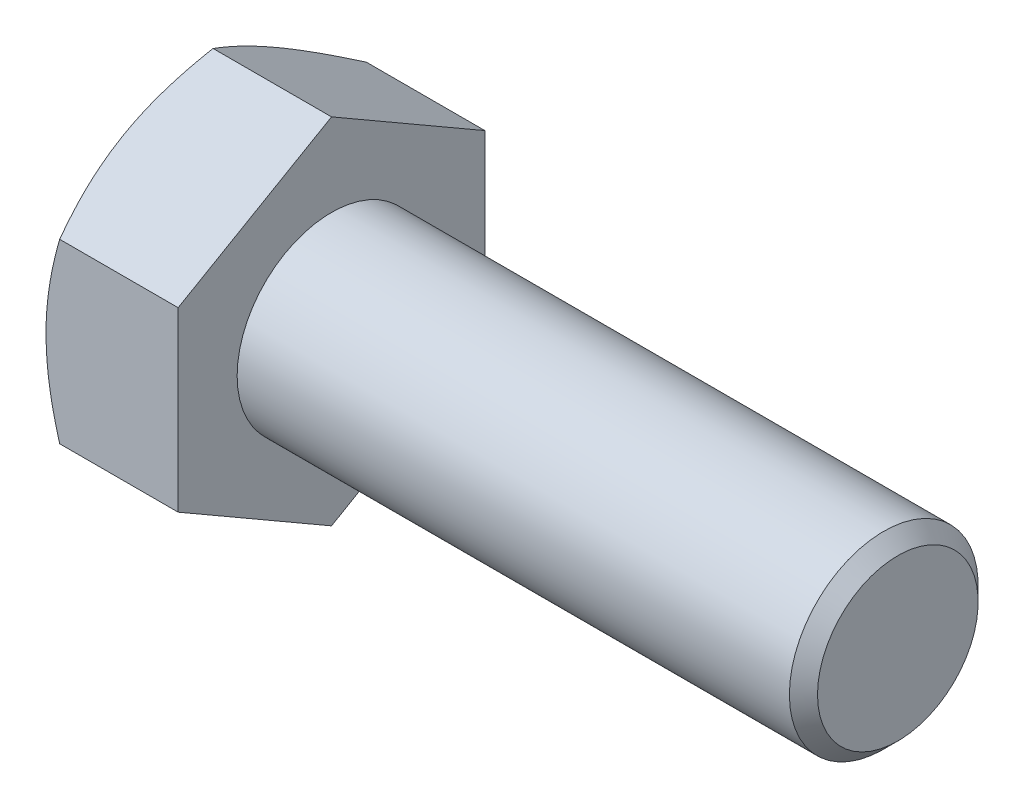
ISO-10303-21;
HEADER;
FILE_DESCRIPTION(('STEP AP214'),'2;1');
FILE_NAME('part.step','',(''),(''),'','','');
FILE_SCHEMA(('AUTOMOTIVE_DESIGN { 1 0 10303 214 1 1 1 1 }'));
ENDSEC;
DATA;
#1=APPLICATION_CONTEXT('core data for automotive mechanical design processes');
#2=APPLICATION_PROTOCOL_DEFINITION('international standard','automotive_design',2000,#1);
#3=PRODUCT_CONTEXT('',#1,'mechanical');
#4=PRODUCT('Part','Part','',(#3));
#5=PRODUCT_RELATED_PRODUCT_CATEGORY('part','',(#4));
#6=PRODUCT_DEFINITION_FORMATION('','',#4);
#7=PRODUCT_DEFINITION_CONTEXT('part definition',#1,'design');
#8=PRODUCT_DEFINITION('design','',#6,#7);
#9=PRODUCT_DEFINITION_SHAPE('','',#8);
#10=(LENGTH_UNIT() NAMED_UNIT(*) SI_UNIT(.MILLI.,.METRE.));
#11=(NAMED_UNIT(*) PLANE_ANGLE_UNIT() SI_UNIT($,.RADIAN.));
#12=(NAMED_UNIT(*) SI_UNIT($,.STERADIAN.) SOLID_ANGLE_UNIT());
#13=UNCERTAINTY_MEASURE_WITH_UNIT(LENGTH_MEASURE(1.E-05),#10,'distance_accuracy_value','');
#14=(GEOMETRIC_REPRESENTATION_CONTEXT(3) GLOBAL_UNCERTAINTY_ASSIGNED_CONTEXT((#13)) GLOBAL_UNIT_ASSIGNED_CONTEXT((#10,
#11,#12)) REPRESENTATION_CONTEXT('',''));
#15=CARTESIAN_POINT('',(0.,0.,0.));
#16=DIRECTION('',(0.,0.,1.));
#17=DIRECTION('',(1.,0.,0.));
#18=AXIS2_PLACEMENT_3D('',#15,#16,#17);
#19=CARTESIAN_POINT('',(17.78,11.9150661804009,-20.6375));
#20=DIRECTION('',(0.,-0.866025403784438,0.500000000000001));
#21=DIRECTION('',(0.,-0.500000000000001,-0.866025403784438));
#22=AXIS2_PLACEMENT_3D('',#19,#20,#21);
#23=PLANE('',#22);
#24=CARTESIAN_POINT('',(1.84333382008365,23.8302478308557,0.000200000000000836));
#25=CARTESIAN_POINT('',(1.69214337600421,23.5683597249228,-0.453403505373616));
#26=CARTESIAN_POINT('',(1.54781374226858,23.3054501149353,-0.908776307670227));
#27=CARTESIAN_POINT('',(1.27478315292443,22.7775226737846,-1.82317345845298));
#28=CARTESIAN_POINT('',(1.14608733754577,22.512504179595,-2.28219895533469));
#29=CARTESIAN_POINT('',(0.906054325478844,21.9798467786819,-3.20478863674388));
#30=CARTESIAN_POINT('',(0.794758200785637,21.7122032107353,-3.66836089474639));
#31=CARTESIAN_POINT('',(0.591914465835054,21.1750563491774,-4.59872655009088));
#32=CARTESIAN_POINT('',(0.500365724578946,20.9055531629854,-5.06551976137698));
#33=CARTESIAN_POINT('',(0.340910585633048,20.371592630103,-5.99036653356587));
#34=CARTESIAN_POINT('',(0.272476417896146,20.1071749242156,-6.44835143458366));
#35=CARTESIAN_POINT('',(0.157727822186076,19.5771279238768,-7.36641976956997));
#36=CARTESIAN_POINT('',(0.111413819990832,19.3114986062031,-7.82650324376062));
#37=CARTESIAN_POINT('',(0.0420749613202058,18.7797937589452,-8.74744305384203));
#38=CARTESIAN_POINT('',(0.0190224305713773,18.5137191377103,-9.2082978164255));
#39=CARTESIAN_POINT('',(-0.00329774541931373,17.9813243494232,-10.1304326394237));
#40=CARTESIAN_POINT('',(-0.00256612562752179,17.7150041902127,-10.591712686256));
#41=CARTESIAN_POINT('',(0.0210208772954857,17.2171134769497,-11.4540846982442));
#42=CARTESIAN_POINT('',(0.0410000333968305,16.9855074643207,-11.8552380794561));
#43=CARTESIAN_POINT('',(0.0985671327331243,16.5228483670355,-12.656587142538));
#44=CARTESIAN_POINT('',(0.136154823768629,16.2917952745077,-13.056782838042));
#45=CARTESIAN_POINT('',(0.228287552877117,15.8303273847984,-13.8560686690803));
#46=CARTESIAN_POINT('',(0.282847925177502,15.5999133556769,-14.2551574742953));
#47=CARTESIAN_POINT('',(0.407960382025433,15.1401885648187,-15.0514241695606));
#48=CARTESIAN_POINT('',(0.478512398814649,14.9108777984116,-15.4486020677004));
#49=CARTESIAN_POINT('',(0.715966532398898,14.2147390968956,-16.654349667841));
#50=CARTESIAN_POINT('',(0.906558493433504,13.749889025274,-17.4594936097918));
#51=CARTESIAN_POINT('',(1.23103244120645,13.057747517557,-18.6583178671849));
#52=CARTESIAN_POINT('',(1.34550466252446,12.8280876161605,-19.0561004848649));
#53=CARTESIAN_POINT('',(1.58603801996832,12.3703563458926,-19.8489143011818));
#54=CARTESIAN_POINT('',(1.7120958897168,12.1422845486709,-20.2439462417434));
#55=CARTESIAN_POINT('',(1.84333382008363,11.914950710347,-20.6377));
#56=B_SPLINE_CURVE_WITH_KNOTS('',3,(#24,#25,#26,#27,#28,#29,#30,#31,#32,#33,#34,#35,#36,#37,#38,
#39,#40,#41,#42,#43,#44,#45,#46,#47,#48,#49,#50,#51,#52,#53,#54,#55),.UNSPECIFIED.,.F.,.F.,(4,2,
2,2,2,2,2,2,2,2,2,2,2,2,2,4),(0.,1.63552456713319,3.2715854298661,4.91145173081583,
6.55122408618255,8.15052346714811,9.74985363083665,11.3472788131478,12.9446546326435,
14.3352468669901,15.7258191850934,17.1176515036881,18.5094779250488,21.3544387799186,
22.7744411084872,24.1940443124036),.UNSPECIFIED.);
#57=CARTESIAN_POINT('',(1.84326715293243,23.8301323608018,0.));
#58=VERTEX_POINT('',#57);
#59=CARTESIAN_POINT('',(0.,17.8725992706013,-10.31875));
#60=VERTEX_POINT('',#59);
#61=EDGE_CURVE('E55',#58,#60,#56,.T.);
#62=ORIENTED_EDGE('',*,*,#61,.F.);
#63=DIRECTION('',(-1.,0.,0.));
#64=VECTOR('',#63,1.);
#65=CARTESIAN_POINT('',(17.78,23.8301323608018,0.));
#66=LINE('',#65,#64);
#67=CARTESIAN_POINT('',(17.78,23.8301323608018,0.));
#68=VERTEX_POINT('',#67);
#69=EDGE_CURVE('E151',#68,#58,#66,.T.);
#70=ORIENTED_EDGE('',*,*,#69,.F.);
#71=DIRECTION('',(0.,0.500000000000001,0.866025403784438));
#72=VECTOR('',#71,1.);
#73=CARTESIAN_POINT('',(17.78,11.9150661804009,-20.6375));
#74=LINE('',#73,#72);
#75=CARTESIAN_POINT('',(17.78,11.9150661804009,-20.6375));
#76=VERTEX_POINT('',#75);
#77=EDGE_CURVE('E242',#76,#68,#74,.T.);
#78=ORIENTED_EDGE('',*,*,#77,.F.);
#79=DIRECTION('',(-1.,0.,0.));
#80=VECTOR('',#79,1.);
#81=CARTESIAN_POINT('',(17.78,11.9150661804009,-20.6375));
#82=LINE('',#81,#80);
#83=CARTESIAN_POINT('',(1.84326715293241,11.9150661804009,-20.6375));
#84=VERTEX_POINT('',#83);
#85=EDGE_CURVE('E139',#76,#84,#82,.T.);
#86=ORIENTED_EDGE('',*,*,#85,.T.);
#87=EDGE_CURVE('E133',#60,#84,#56,.T.);
#88=ORIENTED_EDGE('',*,*,#87,.F.);
#89=EDGE_LOOP('',(#62,#70,#78,#86,#88));
#90=FACE_BOUND('',#89,.T.);
#91=ADVANCED_FACE('F39',(#90),#23,.F.);
#92=CARTESIAN_POINT('',(17.78,23.8301323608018,0.));
#93=DIRECTION('',(0.,-0.866025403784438,-0.500000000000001));
#94=DIRECTION('',(0.,0.500000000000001,-0.866025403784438));
#95=AXIS2_PLACEMENT_3D('',#92,#93,#94);
#96=PLANE('',#95);
#97=CARTESIAN_POINT('',(1.84333382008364,11.914950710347,20.6377));
#98=CARTESIAN_POINT('',(1.69214337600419,12.1768388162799,20.1840964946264));
#99=CARTESIAN_POINT('',(1.54781374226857,12.4397484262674,19.7287236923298));
#100=CARTESIAN_POINT('',(1.27478315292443,12.9676758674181,18.814326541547));
#101=CARTESIAN_POINT('',(1.14608733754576,13.2326943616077,18.3553010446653));
#102=CARTESIAN_POINT('',(0.906054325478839,13.7653517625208,17.4327113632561));
#103=CARTESIAN_POINT('',(0.794758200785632,14.0329953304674,16.9691391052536));
#104=CARTESIAN_POINT('',(0.591914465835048,14.5701421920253,16.0387734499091));
#105=CARTESIAN_POINT('',(0.50036572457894,14.8396453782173,15.571980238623));
#106=CARTESIAN_POINT('',(0.340910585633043,15.3736059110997,14.6471334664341));
#107=CARTESIAN_POINT('',(0.272476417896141,15.6380236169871,14.1891485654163));
#108=CARTESIAN_POINT('',(0.157727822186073,16.1680706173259,13.27108023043));
#109=CARTESIAN_POINT('',(0.11141381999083,16.4336999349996,12.8109967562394));
#110=CARTESIAN_POINT('',(0.0420749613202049,16.9654047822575,11.890056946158));
#111=CARTESIAN_POINT('',(0.019022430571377,17.2314794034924,11.4292021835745));
#112=CARTESIAN_POINT('',(-0.00329774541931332,17.7638741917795,10.5070673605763));
#113=CARTESIAN_POINT('',(-0.00256612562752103,18.03019435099,10.045787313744));
#114=CARTESIAN_POINT('',(0.0210208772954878,18.528085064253,9.18341530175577));
#115=CARTESIAN_POINT('',(0.0410000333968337,18.759691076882,8.78226192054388));
#116=CARTESIAN_POINT('',(0.0985671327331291,19.2223501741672,7.98091285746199));
#117=CARTESIAN_POINT('',(0.136154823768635,19.4534032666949,7.58071716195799));
#118=CARTESIAN_POINT('',(0.228287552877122,19.9148711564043,6.78143133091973));
#119=CARTESIAN_POINT('',(0.282847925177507,20.1452851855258,6.38234252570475));
#120=CARTESIAN_POINT('',(0.407960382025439,20.605009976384,5.58607583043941));
#121=CARTESIAN_POINT('',(0.478512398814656,20.8343207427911,5.18889793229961));
#122=CARTESIAN_POINT('',(0.715966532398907,21.530459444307,3.98315033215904));
#123=CARTESIAN_POINT('',(0.906558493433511,21.9953095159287,3.17800639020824));
#124=CARTESIAN_POINT('',(1.23103244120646,22.6874510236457,1.97918213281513));
#125=CARTESIAN_POINT('',(1.34550466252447,22.9171109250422,1.58139951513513));
#126=CARTESIAN_POINT('',(1.58603801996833,23.3748421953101,0.788585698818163));
#127=CARTESIAN_POINT('',(1.71209588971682,23.6029139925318,0.393553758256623));
#128=CARTESIAN_POINT('',(1.84333382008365,23.8302478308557,-0.000199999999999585));
#129=B_SPLINE_CURVE_WITH_KNOTS('',3,(#97,#98,#99,#100,#101,#102,#103,#104,#105,#106,#107,#108,
#109,#110,#111,#112,#113,#114,#115,#116,#117,#118,#119,#120,#121,#122,#123,#124,#125,#126,#127,
#128),.UNSPECIFIED.,.F.,.F.,(4,2,2,2,2,2,2,2,2,2,2,2,2,2,2,4),(0.,1.63552456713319,
3.27158542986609,4.91145173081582,6.55122408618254,8.1505234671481,9.74985363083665,
11.3472788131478,12.9446546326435,14.3352468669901,15.7258191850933,17.1176515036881,
18.5094779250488,21.3544387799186,22.7744411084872,24.1940443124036),.UNSPECIFIED.);
#130=CARTESIAN_POINT('',(1.84326715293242,11.9150661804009,20.6375));
#131=VERTEX_POINT('',#130);
#132=CARTESIAN_POINT('',(0.,17.8725992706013,10.31875));
#133=VERTEX_POINT('',#132);
#134=EDGE_CURVE('E62',#131,#133,#129,.T.);
#135=ORIENTED_EDGE('',*,*,#134,.F.);
#136=DIRECTION('',(-1.,0.,0.));
#137=VECTOR('',#136,1.);
#138=CARTESIAN_POINT('',(17.78,11.9150661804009,20.6375));
#139=LINE('',#138,#137);
#140=CARTESIAN_POINT('',(17.78,11.9150661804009,20.6375));
#141=VERTEX_POINT('',#140);
#142=EDGE_CURVE('E149',#141,#131,#139,.T.);
#143=ORIENTED_EDGE('',*,*,#142,.F.);
#144=DIRECTION('',(0.,-0.500000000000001,0.866025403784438));
#145=VECTOR('',#144,1.);
#146=CARTESIAN_POINT('',(17.78,23.8301323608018,0.));
#147=LINE('',#146,#145);
#148=EDGE_CURVE('E240',#68,#141,#147,.T.);
#149=ORIENTED_EDGE('',*,*,#148,.F.);
#150=ORIENTED_EDGE('',*,*,#69,.T.);
#151=EDGE_CURVE('E166',#133,#58,#129,.T.);
#152=ORIENTED_EDGE('',*,*,#151,.F.);
#153=EDGE_LOOP('',(#135,#143,#149,#150,#152));
#154=FACE_BOUND('',#153,.T.);
#155=ADVANCED_FACE('F172',(#154),#96,.F.);
#156=CARTESIAN_POINT('',(17.78,11.9150661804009,20.6375));
#157=DIRECTION('',(0.,0.,-1.));
#158=DIRECTION('',(0.,1.,0.));
#159=AXIS2_PLACEMENT_3D('',#156,#157,#158);
#160=PLANE('',#159);
#161=CARTESIAN_POINT('',(10.1233678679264,-32.1118563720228,20.6375));
#162=CARTESIAN_POINT('',(9.90427008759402,-31.6607456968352,20.6375));
#163=CARTESIAN_POINT('',(9.68625680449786,-31.2091085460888,20.6375));
#164=CARTESIAN_POINT('',(9.25264463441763,-30.3046714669,20.6375));
#165=CARTESIAN_POINT('',(9.03704577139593,-29.851871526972,20.6375));
#166=CARTESIAN_POINT('',(8.39418278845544,-28.4914436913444,20.6375));
#167=CARTESIAN_POINT('',(7.97091645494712,-27.5819195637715,20.6375));
#168=CARTESIAN_POINT('',(7.13532758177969,-25.7519215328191,20.6375));
#169=CARTESIAN_POINT('',(6.72307624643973,-24.8314150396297,20.6375));
#170=CARTESIAN_POINT('',(5.91529515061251,-22.9831190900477,20.6375));
#171=CARTESIAN_POINT('',(5.51976460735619,-22.0553299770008,20.6375));
#172=CARTESIAN_POINT('',(4.73729219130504,-20.1605940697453,20.6375));
#173=CARTESIAN_POINT('',(4.35105046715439,-19.1933566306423,20.6375));
#174=CARTESIAN_POINT('',(3.60754060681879,-17.2475981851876,20.6375));
#175=CARTESIAN_POINT('',(3.25027570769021,-16.2690759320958,20.6375));
#176=CARTESIAN_POINT('',(2.57402614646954,-14.3010202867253,20.6375));
#177=CARTESIAN_POINT('',(2.25496489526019,-13.3115134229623,20.6375));
#178=CARTESIAN_POINT('',(1.66527212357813,-11.318212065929,20.6375));
#179=CARTESIAN_POINT('',(1.39462546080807,-10.3144221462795,20.6375));
#180=CARTESIAN_POINT('',(1.03545163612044,-8.80063418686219,20.6375));
#181=CARTESIAN_POINT('',(0.923771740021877,-8.29609693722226,20.6375));
#182=CARTESIAN_POINT('',(0.717329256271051,-7.28355521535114,20.6375));
#183=CARTESIAN_POINT('',(0.622566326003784,-6.7755508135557,20.6375));
#184=CARTESIAN_POINT('',(0.451625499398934,-5.75642686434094,20.6375));
#185=CARTESIAN_POINT('',(0.375446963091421,-5.24530742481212,20.6375));
#186=CARTESIAN_POINT('',(0.243185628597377,-4.22045710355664,20.6375));
#187=CARTESIAN_POINT('',(0.187102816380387,-3.70672622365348,20.6375));
#188=CARTESIAN_POINT('',(0.0968611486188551,-2.68415366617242,20.6375));
#189=CARTESIAN_POINT('',(0.0624231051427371,-2.17533677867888,20.6375));
#190=CARTESIAN_POINT('',(0.0151010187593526,-1.15670325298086,20.6375));
#191=CARTESIAN_POINT('',(0.00221661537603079,-0.646886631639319,20.6375));
#192=CARTESIAN_POINT('',(-0.00169134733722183,0.372835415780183,20.6375));
#193=CARTESIAN_POINT('',(0.00728516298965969,0.882740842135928,20.6375));
#194=CARTESIAN_POINT('',(0.0468787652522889,1.9017164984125,20.6375));
#195=CARTESIAN_POINT('',(0.0774968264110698,2.41078668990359,20.6375));
#196=CARTESIAN_POINT('',(0.176174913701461,3.63103902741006,20.6375));
#197=CARTESIAN_POINT('',(0.254325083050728,4.34141978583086,20.6375));
#198=CARTESIAN_POINT('',(0.448536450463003,5.75698322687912,20.6375));
#199=CARTESIAN_POINT('',(0.564602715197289,6.46216520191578,20.6375));
#200=CARTESIAN_POINT('',(0.830517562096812,7.86663403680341,20.6375));
#201=CARTESIAN_POINT('',(0.98039219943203,8.56591591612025,20.6375));
#202=CARTESIAN_POINT('',(1.30934404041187,9.95750121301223,20.6375));
#203=CARTESIAN_POINT('',(1.48842082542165,10.6498047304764,20.6375));
#204=CARTESIAN_POINT('',(1.8756560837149,12.0426964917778,20.6375));
#205=CARTESIAN_POINT('',(2.08437031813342,12.7431291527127,20.6375));
#206=CARTESIAN_POINT('',(2.52357115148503,14.1370960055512,20.6375));
#207=CARTESIAN_POINT('',(2.75405789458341,14.8306301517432,20.6375));
#208=CARTESIAN_POINT('',(3.2331260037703,16.2111388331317,20.6375));
#209=CARTESIAN_POINT('',(3.48170148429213,16.8981154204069,20.6375));
#210=CARTESIAN_POINT('',(3.99400235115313,18.2663626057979,20.6375));
#211=CARTESIAN_POINT('',(4.25772755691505,18.9476332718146,20.6375));
#212=CARTESIAN_POINT('',(4.8988376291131,20.5590145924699,20.6375));
#213=CARTESIAN_POINT('',(5.28183896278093,21.4868873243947,20.6375));
#214=CARTESIAN_POINT('',(6.06661514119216,23.3346835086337,20.6375));
#215=CARTESIAN_POINT('',(6.46839117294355,24.2546064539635,20.6375));
#216=CARTESIAN_POINT('',(7.28694571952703,26.0879885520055,20.6375));
#217=CARTESIAN_POINT('',(7.703727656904,27.001446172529,20.6375));
#218=CARTESIAN_POINT('',(8.54925608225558,28.8227686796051,20.6375));
#219=CARTESIAN_POINT('',(8.97800230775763,29.7306336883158,20.6375));
#220=CARTESIAN_POINT('',(9.84569867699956,31.5427118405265,20.6375));
#221=CARTESIAN_POINT('',(10.2846596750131,32.4469197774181,20.6375));
#222=CARTESIAN_POINT('',(11.1705735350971,34.2514113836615,20.6375));
#223=CARTESIAN_POINT('',(11.6175264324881,35.1516950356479,20.6375));
#224=CARTESIAN_POINT('',(12.517991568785,36.9488265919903,20.6375));
#225=CARTESIAN_POINT('',(12.9715029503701,37.845674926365,20.6375));
#226=CARTESIAN_POINT('',(13.8840629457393,39.6365449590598,20.6375));
#227=CARTESIAN_POINT('',(14.3431115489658,40.5305666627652,20.6375));
#228=CARTESIAN_POINT('',(15.6493121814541,43.0582372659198,20.6375));
#229=CARTESIAN_POINT('',(16.5019361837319,44.6890583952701,20.6375));
#230=CARTESIAN_POINT('',(18.218831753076,47.944618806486,20.6375));
#231=CARTESIAN_POINT('',(19.0831037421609,49.5693578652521,20.6375));
#232=CARTESIAN_POINT('',(20.8183569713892,52.8099478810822,20.6375));
#233=CARTESIAN_POINT('',(21.6893156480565,54.4258109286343,20.6375));
#234=CARTESIAN_POINT('',(23.000931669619,56.8467384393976,20.6375));
#235=CARTESIAN_POINT('',(23.4389878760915,57.6532142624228,20.6375));
#236=CARTESIAN_POINT('',(24.3166534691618,59.2653187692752,20.6375));
#237=CARTESIAN_POINT('',(24.756262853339,60.0709474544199,20.6375));
#238=CARTESIAN_POINT('',(25.1965591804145,60.8762006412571,20.6375));
#239=B_SPLINE_CURVE_WITH_KNOTS('',3,(#161,#162,#163,#164,#165,#166,#167,#168,#169,#170,#171,
#172,#173,#174,#175,#176,#177,#178,#179,#180,#181,#182,#183,#184,#185,#186,#187,#188,#189,#190,
#191,#192,#193,#194,#195,#196,#197,#198,#199,#200,#201,#202,#203,#204,#205,#206,#207,#208,#209,
#210,#211,#212,#213,#214,#215,#216,#217,#218,#219,#220,#221,#222,#223,#224,#225,#226,#227,#228,
#229,#230,#231,#232,#233,#234,#235,#236,#237,#238),.UNSPECIFIED.,.F.,.F.,(4,2,2,2,2,2,2,2,2,2,2,
2,2,2,2,2,2,2,2,2,2,2,2,2,2,2,2,2,2,2,2,2,2,2,2,2,2,2,4),(0.,1.5045045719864,3.00902406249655,
6.01850276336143,9.04418712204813,12.0697296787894,15.1938876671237,18.3183941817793,
21.4365280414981,24.5536849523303,26.1036962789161,27.6536762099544,29.2036027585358,
30.7535282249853,32.2830277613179,33.8125017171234,35.341980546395,36.8715278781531,
39.0143441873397,41.1574469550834,43.302207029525,45.4469363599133,47.6391167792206,
49.8313117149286,52.0227965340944,54.2142552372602,57.2254091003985,60.2367535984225,
63.2487893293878,66.260759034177,69.2760903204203,72.2914349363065,75.3063888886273,
78.3213370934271,83.8420362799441,89.362936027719,94.8698395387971,97.6231396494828,
100.376435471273),.UNSPECIFIED.);
#240=CARTESIAN_POINT('',(1.84326715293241,-11.9150661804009,20.6375));
#241=VERTEX_POINT('',#240);
#242=CARTESIAN_POINT('',(0.,0.,20.6375));
#243=VERTEX_POINT('',#242);
#244=EDGE_CURVE('E252',#241,#243,#239,.T.);
#245=ORIENTED_EDGE('',*,*,#244,.F.);
#246=DIRECTION('',(-1.,0.,0.));
#247=VECTOR('',#246,1.);
#248=CARTESIAN_POINT('',(17.78,-11.9150661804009,20.6375));
#249=LINE('',#248,#247);
#250=CARTESIAN_POINT('',(17.78,-11.9150661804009,20.6375));
#251=VERTEX_POINT('',#250);
#252=EDGE_CURVE('E141',#251,#241,#249,.T.);
#253=ORIENTED_EDGE('',*,*,#252,.F.);
#254=DIRECTION('',(0.,-1.,0.));
#255=VECTOR('',#254,1.);
#256=CARTESIAN_POINT('',(17.78,11.9150661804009,20.6375));
#257=LINE('',#256,#255);
#258=EDGE_CURVE('E236',#141,#251,#257,.T.);
#259=ORIENTED_EDGE('',*,*,#258,.F.);
#260=ORIENTED_EDGE('',*,*,#142,.T.);
#261=EDGE_CURVE('E190',#243,#131,#239,.T.);
#262=ORIENTED_EDGE('',*,*,#261,.F.);
#263=EDGE_LOOP('',(#245,#253,#259,#260,#262));
#264=FACE_BOUND('',#263,.T.);
#265=ADVANCED_FACE('F258',(#264),#160,.F.);
#266=CARTESIAN_POINT('',(17.78,-23.8301323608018,0.));
#267=DIRECTION('',(0.,0.866025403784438,-0.500000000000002));
#268=DIRECTION('',(0.,0.500000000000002,0.866025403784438));
#269=AXIS2_PLACEMENT_3D('',#266,#267,#268);
#270=PLANE('',#269);
#271=CARTESIAN_POINT('',(1.84333382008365,-23.8302478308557,-0.000200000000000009));
#272=CARTESIAN_POINT('',(1.69214337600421,-23.5683597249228,0.453403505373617));
#273=CARTESIAN_POINT('',(1.54781374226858,-23.3054501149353,0.908776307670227));
#274=CARTESIAN_POINT('',(1.27478315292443,-22.7775226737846,1.82317345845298));
#275=CARTESIAN_POINT('',(1.14608733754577,-22.512504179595,2.28219895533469));
#276=CARTESIAN_POINT('',(0.906054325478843,-21.9798467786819,3.20478863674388));
#277=CARTESIAN_POINT('',(0.794758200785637,-21.7122032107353,3.66836089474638));
#278=CARTESIAN_POINT('',(0.591914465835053,-21.1750563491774,4.59872655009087));
#279=CARTESIAN_POINT('',(0.500365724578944,-20.9055531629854,5.06551976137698));
#280=CARTESIAN_POINT('',(0.340910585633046,-20.371592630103,5.99036653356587));
#281=CARTESIAN_POINT('',(0.272476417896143,-20.1071749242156,6.44835143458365));
#282=CARTESIAN_POINT('',(0.157727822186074,-19.5771279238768,7.36641976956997));
#283=CARTESIAN_POINT('',(0.11141381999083,-19.3114986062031,7.82650324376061));
#284=CARTESIAN_POINT('',(0.0420749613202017,-18.7797937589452,8.74744305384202));
#285=CARTESIAN_POINT('',(0.0190224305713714,-18.5137191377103,9.20829781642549));
#286=CARTESIAN_POINT('',(-0.00329774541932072,-17.9813243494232,10.1304326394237));
#287=CARTESIAN_POINT('',(-0.00256612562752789,-17.7150041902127,10.591712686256));
#288=CARTESIAN_POINT('',(0.0210208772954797,-17.2171134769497,11.4540846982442));
#289=CARTESIAN_POINT('',(0.0410000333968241,-16.9855074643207,11.8552380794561));
#290=CARTESIAN_POINT('',(0.0985671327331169,-16.5228483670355,12.656587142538));
#291=CARTESIAN_POINT('',(0.136154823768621,-16.2917952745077,13.056782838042));
#292=CARTESIAN_POINT('',(0.228287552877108,-15.8303273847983,13.8560686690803));
#293=CARTESIAN_POINT('',(0.282847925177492,-15.5999133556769,14.2551574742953));
#294=CARTESIAN_POINT('',(0.407960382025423,-15.1401885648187,15.0514241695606));
#295=CARTESIAN_POINT('',(0.47851239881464,-14.9108777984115,15.4486020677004));
#296=CARTESIAN_POINT('',(0.715966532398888,-14.2147390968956,16.654349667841));
#297=CARTESIAN_POINT('',(0.906558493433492,-13.7498890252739,17.4594936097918));
#298=CARTESIAN_POINT('',(1.23103244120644,-13.057747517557,18.6583178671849));
#299=CARTESIAN_POINT('',(1.34550466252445,-12.8280876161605,19.0561004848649));
#300=CARTESIAN_POINT('',(1.58603801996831,-12.3703563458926,19.8489143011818));
#301=CARTESIAN_POINT('',(1.7120958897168,-12.1422845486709,20.2439462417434));
#302=CARTESIAN_POINT('',(1.84333382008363,-11.914950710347,20.6377));
#303=B_SPLINE_CURVE_WITH_KNOTS('',3,(#271,#272,#273,#274,#275,#276,#277,#278,#279,#280,#281,
#282,#283,#284,#285,#286,#287,#288,#289,#290,#291,#292,#293,#294,#295,#296,#297,#298,#299,#300,
#301,#302),.UNSPECIFIED.,.F.,.F.,(4,2,2,2,2,2,2,2,2,2,2,2,2,2,2,4),(0.,1.63552456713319,
3.27158542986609,4.91145173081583,6.55122408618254,8.1505234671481,9.74985363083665,
11.3472788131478,12.9446546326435,14.3352468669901,15.7258191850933,17.1176515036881,
18.5094779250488,21.3544387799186,22.7744411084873,24.1940443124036),.UNSPECIFIED.);
#304=CARTESIAN_POINT('',(1.84326715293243,-23.8301323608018,0.));
#305=VERTEX_POINT('',#304);
#306=CARTESIAN_POINT('',(0.,-17.8725992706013,10.31875));
#307=VERTEX_POINT('',#306);
#308=EDGE_CURVE('E174',#305,#307,#303,.T.);
#309=ORIENTED_EDGE('',*,*,#308,.F.);
#310=DIRECTION('',(-1.,0.,0.));
#311=VECTOR('',#310,1.);
#312=CARTESIAN_POINT('',(17.78,-23.8301323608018,0.));
#313=LINE('',#312,#311);
#314=CARTESIAN_POINT('',(17.78,-23.8301323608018,0.));
#315=VERTEX_POINT('',#314);
#316=EDGE_CURVE('E138',#315,#305,#313,.T.);
#317=ORIENTED_EDGE('',*,*,#316,.F.);
#318=DIRECTION('',(0.,-0.500000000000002,-0.866025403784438));
#319=VECTOR('',#318,1.);
#320=CARTESIAN_POINT('',(17.78,-23.8301323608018,0.));
#321=LINE('',#320,#319);
#322=EDGE_CURVE('E234',#251,#315,#321,.T.);
#323=ORIENTED_EDGE('',*,*,#322,.F.);
#324=ORIENTED_EDGE('',*,*,#252,.T.);
#325=EDGE_CURVE('E176',#307,#241,#303,.T.);
#326=ORIENTED_EDGE('',*,*,#325,.F.);
#327=EDGE_LOOP('',(#309,#317,#323,#324,#326));
#328=FACE_BOUND('',#327,.T.);
#329=ADVANCED_FACE('F230',(#328),#270,.F.);
#330=CARTESIAN_POINT('',(17.78,-11.9150661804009,-20.6375));
#331=DIRECTION('',(0.,0.866025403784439,0.5));
#332=DIRECTION('',(0.,-0.5,0.866025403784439));
#333=AXIS2_PLACEMENT_3D('',#330,#331,#332);
#334=PLANE('',#333);
#335=CARTESIAN_POINT('',(1.84333382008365,-11.9149507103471,-20.6377));
#336=CARTESIAN_POINT('',(1.69214337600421,-12.1768388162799,-20.1840964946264));
#337=CARTESIAN_POINT('',(1.54781374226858,-12.4397484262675,-19.7287236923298));
#338=CARTESIAN_POINT('',(1.27478315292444,-12.9676758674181,-18.814326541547));
#339=CARTESIAN_POINT('',(1.14608733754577,-13.2326943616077,-18.3553010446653));
#340=CARTESIAN_POINT('',(0.90605432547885,-13.7653517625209,-17.4327113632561));
#341=CARTESIAN_POINT('',(0.794758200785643,-14.0329953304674,-16.9691391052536));
#342=CARTESIAN_POINT('',(0.591914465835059,-14.5701421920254,-16.0387734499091));
#343=CARTESIAN_POINT('',(0.500365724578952,-14.8396453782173,-15.571980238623));
#344=CARTESIAN_POINT('',(0.340910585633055,-15.3736059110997,-14.6471334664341));
#345=CARTESIAN_POINT('',(0.272476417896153,-15.6380236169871,-14.1891485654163));
#346=CARTESIAN_POINT('',(0.157727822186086,-16.1680706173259,-13.27108023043));
#347=CARTESIAN_POINT('',(0.111413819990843,-16.4336999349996,-12.8109967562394));
#348=CARTESIAN_POINT('',(0.0420749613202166,-16.9654047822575,-11.890056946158));
#349=CARTESIAN_POINT('',(0.0190224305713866,-17.2314794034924,-11.4292021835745));
#350=CARTESIAN_POINT('',(-0.0032977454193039,-17.7638741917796,-10.5070673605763));
#351=CARTESIAN_POINT('',(-0.00256612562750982,-18.03019435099,-10.045787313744));
#352=CARTESIAN_POINT('',(0.0210208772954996,-18.528085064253,-9.18341530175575));
#353=CARTESIAN_POINT('',(0.0410000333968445,-18.759691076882,-8.78226192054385));
#354=CARTESIAN_POINT('',(0.0985671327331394,-19.2223501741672,-7.98091285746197));
#355=CARTESIAN_POINT('',(0.136154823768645,-19.453403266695,-7.58071716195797));
#356=CARTESIAN_POINT('',(0.228287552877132,-19.9148711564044,-6.78143133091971));
#357=CARTESIAN_POINT('',(0.282847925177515,-20.1452851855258,-6.38234252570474));
#358=CARTESIAN_POINT('',(0.407960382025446,-20.605009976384,-5.5860758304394));
#359=CARTESIAN_POINT('',(0.478512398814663,-20.8343207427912,-5.1888979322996));
#360=CARTESIAN_POINT('',(0.715966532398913,-21.5304594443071,-3.98315033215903));
#361=CARTESIAN_POINT('',(0.906558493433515,-21.9953095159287,-3.17800639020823));
#362=CARTESIAN_POINT('',(1.23103244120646,-22.6874510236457,-1.97918213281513));
#363=CARTESIAN_POINT('',(1.34550466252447,-22.9171109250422,-1.58139951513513));
#364=CARTESIAN_POINT('',(1.58603801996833,-23.3748421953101,-0.788585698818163));
#365=CARTESIAN_POINT('',(1.71209588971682,-23.6029139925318,-0.393553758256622));
#366=CARTESIAN_POINT('',(1.84333382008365,-23.8302478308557,0.000199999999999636));
#367=B_SPLINE_CURVE_WITH_KNOTS('',3,(#335,#336,#337,#338,#339,#340,#341,#342,#343,#344,#345,
#346,#347,#348,#349,#350,#351,#352,#353,#354,#355,#356,#357,#358,#359,#360,#361,#362,#363,#364,
#365,#366),.UNSPECIFIED.,.F.,.F.,(4,2,2,2,2,2,2,2,2,2,2,2,2,2,2,4),(0.,1.63552456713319,
3.27158542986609,4.91145173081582,6.55122408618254,8.1505234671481,9.74985363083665,
11.3472788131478,12.9446546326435,14.3352468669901,15.7258191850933,17.1176515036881,
18.5094779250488,21.3544387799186,22.7744411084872,24.1940443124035),.UNSPECIFIED.);
#368=CARTESIAN_POINT('',(1.84326715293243,-11.9150661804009,-20.6375));
#369=VERTEX_POINT('',#368);
#370=CARTESIAN_POINT('',(0.,-17.8725992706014,-10.31875));
#371=VERTEX_POINT('',#370);
#372=EDGE_CURVE('E115',#369,#371,#367,.T.);
#373=ORIENTED_EDGE('',*,*,#372,.F.);
#374=DIRECTION('',(-1.,0.,0.));
#375=VECTOR('',#374,1.);
#376=CARTESIAN_POINT('',(17.78,-11.9150661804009,-20.6375));
#377=LINE('',#376,#375);
#378=CARTESIAN_POINT('',(17.78,-11.9150661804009,-20.6375));
#379=VERTEX_POINT('',#378);
#380=EDGE_CURVE('E129',#379,#369,#377,.T.);
#381=ORIENTED_EDGE('',*,*,#380,.F.);
#382=DIRECTION('',(0.,0.5,-0.866025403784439));
#383=VECTOR('',#382,1.);
#384=CARTESIAN_POINT('',(17.78,-11.9150661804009,-20.6375));
#385=LINE('',#384,#383);
#386=EDGE_CURVE('E232',#315,#379,#385,.T.);
#387=ORIENTED_EDGE('',*,*,#386,.F.);
#388=ORIENTED_EDGE('',*,*,#316,.T.);
#389=EDGE_CURVE('E132',#371,#305,#367,.T.);
#390=ORIENTED_EDGE('',*,*,#389,.F.);
#391=EDGE_LOOP('',(#373,#381,#387,#388,#390));
#392=FACE_BOUND('',#391,.T.);
#393=ADVANCED_FACE('F127',(#392),#334,.F.);
#394=CARTESIAN_POINT('',(17.78,11.9150661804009,-20.6375));
#395=DIRECTION('',(0.,0.,1.));
#396=DIRECTION('',(0.,-1.,0.));
#397=AXIS2_PLACEMENT_3D('',#394,#395,#396);
#398=PLANE('',#397);
#399=CARTESIAN_POINT('',(10.1233678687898,-32.1118563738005,-20.6375));
#400=CARTESIAN_POINT('',(9.90427008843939,-31.660745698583,-20.6375));
#401=CARTESIAN_POINT('',(9.68625680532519,-31.2091085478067,-20.6375));
#402=CARTESIAN_POINT('',(9.25264463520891,-30.3046714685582,-20.6375));
#403=CARTESIAN_POINT('',(9.0370457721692,-29.8518715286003,-20.6375));
#404=CARTESIAN_POINT('',(8.39418278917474,-28.4914436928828,-20.6375));
#405=CARTESIAN_POINT('',(7.97091645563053,-27.58191956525,-20.6375));
#406=CARTESIAN_POINT('',(7.13532758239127,-25.7519215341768,-20.6375));
#407=CARTESIAN_POINT('',(6.72307624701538,-24.8314150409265,-20.6375));
#408=CARTESIAN_POINT('',(5.91529515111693,-22.9831190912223,-20.6375));
#409=CARTESIAN_POINT('',(5.51976460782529,-22.0553299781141,-20.6375));
#410=CARTESIAN_POINT('',(4.73729219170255,-20.1605940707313,-20.6375));
#411=CARTESIAN_POINT('',(4.35105046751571,-19.1933566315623,-20.6375));
#412=CARTESIAN_POINT('',(3.60754060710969,-17.2475981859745,-20.6375));
#413=CARTESIAN_POINT('',(3.25027570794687,-16.2690759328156,-20.6375));
#414=CARTESIAN_POINT('',(2.57402614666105,-14.3010202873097,-20.6375));
#415=CARTESIAN_POINT('',(2.25496489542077,-13.3115134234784,-20.6375));
#416=CARTESIAN_POINT('',(1.66527212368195,-11.3182120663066,-20.6375));
#417=CARTESIAN_POINT('',(1.39462546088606,-10.3144221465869,-20.6375));
#418=CARTESIAN_POINT('',(1.03545163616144,-8.80063418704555,-20.6375));
#419=CARTESIAN_POINT('',(0.92377174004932,-8.29609693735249,-20.6375));
#420=CARTESIAN_POINT('',(0.717329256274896,-7.28355521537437,-20.6375));
#421=CARTESIAN_POINT('',(0.622566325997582,-6.77555081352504,-20.6375));
#422=CARTESIAN_POINT('',(0.451625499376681,-5.75642686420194,-20.6375));
#423=CARTESIAN_POINT('',(0.37544696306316,-5.24530742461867,-20.6375));
#424=CARTESIAN_POINT('',(0.24318562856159,-4.22045710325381,-20.6375));
#425=CARTESIAN_POINT('',(0.187102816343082,-3.70672622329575,-20.6375));
#426=CARTESIAN_POINT('',(0.0968611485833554,-2.68415366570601,-20.6375));
#427=CARTESIAN_POINT('',(0.0624231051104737,-2.1753367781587,-20.6375));
#428=CARTESIAN_POINT('',(0.0151010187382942,-1.15670325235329,-20.6375));
#429=CARTESIAN_POINT('',(0.00221661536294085,-0.6468866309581,-20.6375));
#430=CARTESIAN_POINT('',(-0.00169134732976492,0.372835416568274,-20.6375));
#431=CARTESIAN_POINT('',(0.00728516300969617,0.882740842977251,-20.6375));
#432=CARTESIAN_POINT('',(0.0468787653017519,1.90171649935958,-20.6375));
#433=CARTESIAN_POINT('',(0.07749682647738,2.41078669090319,-20.6375));
#434=CARTESIAN_POINT('',(0.176174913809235,3.63103902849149,-20.6375));
#435=CARTESIAN_POINT('',(0.254325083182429,4.34141978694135,-20.6375));
#436=CARTESIAN_POINT('',(0.448536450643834,5.75698322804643,-20.6375));
#437=CARTESIAN_POINT('',(0.564602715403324,6.46216520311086,-20.6375));
#438=CARTESIAN_POINT('',(0.830517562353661,7.86663403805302,-20.6375));
#439=CARTESIAN_POINT('',(0.980392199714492,8.56591591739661,-20.6375));
#440=CARTESIAN_POINT('',(1.30934404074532,9.95750121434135,-20.6375));
#441=CARTESIAN_POINT('',(1.48842082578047,10.6498047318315,-20.6375));
#442=CARTESIAN_POINT('',(1.87565608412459,12.0426964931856,-20.6375));
#443=CARTESIAN_POINT('',(2.08437031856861,12.7431291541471,-20.6375));
#444=CARTESIAN_POINT('',(2.52357115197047,14.1370960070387,-20.6375));
#445=CARTESIAN_POINT('',(2.75405789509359,14.8306301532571,-20.6375));
#446=CARTESIAN_POINT('',(3.23312600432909,16.2111388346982,-20.6375));
#447=CARTESIAN_POINT('',(3.4817014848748,16.8981154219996,-20.6375));
#448=CARTESIAN_POINT('',(3.99400235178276,18.266362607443,-20.6375));
#449=CARTESIAN_POINT('',(4.25772755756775,18.9476332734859,-20.6375));
#450=CARTESIAN_POINT('',(4.89883762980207,20.5590145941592,-20.6375));
#451=CARTESIAN_POINT('',(5.28183896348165,21.4868873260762,-20.6375));
#452=CARTESIAN_POINT('',(6.06661514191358,23.3346835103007,-20.6375));
#453=CARTESIAN_POINT('',(6.46839117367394,24.2546064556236,-20.6375));
#454=CARTESIAN_POINT('',(7.28694572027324,26.0879885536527,-20.6375));
#455=CARTESIAN_POINT('',(7.70372765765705,27.00144617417,-20.6375));
#456=CARTESIAN_POINT('',(8.54925608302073,28.8227686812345,-20.6375));
#457=CARTESIAN_POINT('',(8.97800230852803,29.7306336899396,-20.6375));
#458=CARTESIAN_POINT('',(9.84569867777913,31.5427118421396,-20.6375));
#459=CARTESIAN_POINT('',(10.2846596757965,32.446919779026,-20.6375));
#460=CARTESIAN_POINT('',(11.1705735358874,34.2514113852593,-20.6375));
#461=CARTESIAN_POINT('',(11.6175264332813,35.1516950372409,-20.6375));
#462=CARTESIAN_POINT('',(12.5179915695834,36.948826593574,-20.6375));
#463=CARTESIAN_POINT('',(12.9715029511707,37.8456749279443,-20.6375));
#464=CARTESIAN_POINT('',(13.8840629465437,39.6365449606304,-20.6375));
#465=CARTESIAN_POINT('',(14.3431115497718,40.5305666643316,-20.6375));
#466=CARTESIAN_POINT('',(15.649312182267,43.0582372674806,-20.6375));
#467=CARTESIAN_POINT('',(16.5019361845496,44.6890583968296,-20.6375));
#468=CARTESIAN_POINT('',(18.2188317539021,47.9446188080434,-20.6375));
#469=CARTESIAN_POINT('',(19.0831037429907,49.5693578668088,-20.6375));
#470=CARTESIAN_POINT('',(20.8183569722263,52.8099478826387,-20.6375));
#471=CARTESIAN_POINT('',(21.6893156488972,54.4258109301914,-20.6375));
#472=CARTESIAN_POINT('',(23.0009316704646,56.8467384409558,-20.6375));
#473=CARTESIAN_POINT('',(23.4389878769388,57.6532142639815,-20.6375));
#474=CARTESIAN_POINT('',(24.3166534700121,59.2653187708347,-20.6375));
#475=CARTESIAN_POINT('',(24.7562628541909,60.07094745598,-20.6375));
#476=CARTESIAN_POINT('',(25.1965591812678,60.8762006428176,-20.6375));
#477=B_SPLINE_CURVE_WITH_KNOTS('',3,(#399,#400,#401,#402,#403,#404,#405,#406,#407,#408,#409,
#410,#411,#412,#413,#414,#415,#416,#417,#418,#419,#420,#421,#422,#423,#424,#425,#426,#427,#428,
#429,#430,#431,#432,#433,#434,#435,#436,#437,#438,#439,#440,#441,#442,#443,#444,#445,#446,#447,
#448,#449,#450,#451,#452,#453,#454,#455,#456,#457,#458,#459,#460,#461,#462,#463,#464,#465,#466,
#467,#468,#469,#470,#471,#472,#473,#474,#475,#476),.UNSPECIFIED.,.F.,.F.,(4,2,2,2,2,2,2,2,2,2,2,
2,2,2,2,2,2,2,2,2,2,2,2,2,2,2,2,2,2,2,2,2,2,2,2,2,2,2,4),(0.,1.50450457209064,3.00902406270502,
6.0185027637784,9.04418712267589,12.0697296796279,15.1938876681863,18.3183941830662,
21.4365280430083,24.5536849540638,26.1036962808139,27.6536762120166,29.2036027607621,
30.7535282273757,32.2830277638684,33.8125017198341,35.3419805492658,36.8715278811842,
39.0143441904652,41.1574469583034,43.3022070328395,45.4469363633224,47.6391167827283,
49.8313117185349,52.022796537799,54.2142552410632,57.2254091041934,60.2367536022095,
63.2487893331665,66.2607590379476,69.2760903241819,72.291434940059,75.3063888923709,
78.3213370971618,83.842036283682,89.3629360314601,94.8698395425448,97.623139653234,
100.376435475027),.UNSPECIFIED.);
#478=CARTESIAN_POINT('',(0.,0.,-20.6375));
#479=VERTEX_POINT('',#478);
#480=EDGE_CURVE('E121',#84,#479,#477,.F.);
#481=ORIENTED_EDGE('',*,*,#480,.F.);
#482=ORIENTED_EDGE('',*,*,#85,.F.);
#483=DIRECTION('',(0.,1.,0.));
#484=VECTOR('',#483,1.);
#485=CARTESIAN_POINT('',(17.78,11.9150661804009,-20.6375));
#486=LINE('',#485,#484);
#487=EDGE_CURVE('E137',#379,#76,#486,.T.);
#488=ORIENTED_EDGE('',*,*,#487,.F.);
#489=ORIENTED_EDGE('',*,*,#380,.T.);
#490=EDGE_CURVE('E112',#479,#369,#477,.F.);
#491=ORIENTED_EDGE('',*,*,#490,.F.);
#492=EDGE_LOOP('',(#481,#482,#488,#489,#491));
#493=FACE_BOUND('',#492,.T.);
#494=ADVANCED_FACE('F135',(#493),#398,.F.);
#495=CARTESIAN_POINT('',(17.78,23.8301323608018,0.));
#496=DIRECTION('',(1.,0.,0.));
#497=DIRECTION('',(0.,0.,-1.));
#498=AXIS2_PLACEMENT_3D('',#495,#496,#497);
#499=PLANE('',#498);
#500=CARTESIAN_POINT('',(17.78,0.,0.));
#501=DIRECTION('',(1.,0.,0.));
#502=DIRECTION('',(0.,0.,-1.));
#503=AXIS2_PLACEMENT_3D('',#500,#501,#502);
#504=CIRCLE('',#503,12.7);
#505=CARTESIAN_POINT('',(17.78,0.,-12.7));
#506=VERTEX_POINT('',#505);
#507=EDGE_CURVE('E245',#506,#506,#504,.F.);
#508=ORIENTED_EDGE('',*,*,#507,.T.);
#509=EDGE_LOOP('',(#508));
#510=FACE_BOUND('',#509,.T.);
#511=ORIENTED_EDGE('',*,*,#77,.T.);
#512=ORIENTED_EDGE('',*,*,#148,.T.);
#513=ORIENTED_EDGE('',*,*,#258,.T.);
#514=ORIENTED_EDGE('',*,*,#322,.T.);
#515=ORIENTED_EDGE('',*,*,#386,.T.);
#516=ORIENTED_EDGE('',*,*,#487,.T.);
#517=EDGE_LOOP('',(#511,#512,#513,#514,#515,#516));
#518=FACE_BOUND('',#517,.T.);
#519=ADVANCED_FACE('F260',(#510,#518),#499,.T.);
#520=CARTESIAN_POINT('',(0.,0.,0.));
#521=DIRECTION('',(-1.,0.,0.));
#522=DIRECTION('',(0.,0.,1.));
#523=AXIS2_PLACEMENT_3D('',#520,#521,#522);
#524=CYLINDRICAL_SURFACE('',#523,12.7);
#525=ORIENTED_EDGE('',*,*,#507,.F.);
#526=EDGE_LOOP('',(#525));
#527=FACE_BOUND('',#526,.T.);
#528=CARTESIAN_POINT('',(92.0877,0.,0.));
#529=DIRECTION('',(-1.,0.,0.));
#530=DIRECTION('',(0.,0.,1.));
#531=AXIS2_PLACEMENT_3D('',#528,#529,#530);
#532=CIRCLE('',#531,12.7);
#533=CARTESIAN_POINT('',(92.0877,0.,12.7));
#534=VERTEX_POINT('',#533);
#535=EDGE_CURVE('E248',#534,#534,#532,.T.);
#536=ORIENTED_EDGE('',*,*,#535,.T.);
#537=EDGE_LOOP('',(#536));
#538=FACE_BOUND('',#537,.T.);
#539=ADVANCED_FACE('F292',(#527,#538),#524,.T.);
#540=CARTESIAN_POINT('',(93.98,0.,0.));
#541=DIRECTION('',(-1.,0.,0.));
#542=DIRECTION('',(0.,0.,1.));
#543=AXIS2_PLACEMENT_3D('',#540,#541,#542);
#544=CONICAL_SURFACE('',#543,10.8077,0.785398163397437);
#545=ORIENTED_EDGE('',*,*,#535,.F.);
#546=EDGE_LOOP('',(#545));
#547=FACE_BOUND('',#546,.T.);
#548=CARTESIAN_POINT('',(93.98,0.,0.));
#549=DIRECTION('',(-1.,0.,0.));
#550=DIRECTION('',(0.,0.,1.));
#551=AXIS2_PLACEMENT_3D('',#548,#549,#550);
#552=CIRCLE('',#551,10.8077);
#553=CARTESIAN_POINT('',(93.98,0.,10.8077));
#554=VERTEX_POINT('',#553);
#555=EDGE_CURVE('E250',#554,#554,#552,.T.);
#556=ORIENTED_EDGE('',*,*,#555,.T.);
#557=EDGE_LOOP('',(#556));
#558=FACE_BOUND('',#557,.T.);
#559=ADVANCED_FACE('F295',(#547,#558),#544,.T.);
#560=CARTESIAN_POINT('',(93.98,0.,0.));
#561=DIRECTION('',(-1.,0.,0.));
#562=DIRECTION('',(0.,0.,1.));
#563=AXIS2_PLACEMENT_3D('',#560,#561,#562);
#564=PLANE('',#563);
#565=ORIENTED_EDGE('',*,*,#555,.F.);
#566=EDGE_LOOP('',(#565));
#567=FACE_BOUND('',#566,.T.);
#568=ADVANCED_FACE('F204',(#567),#564,.F.);
#569=CARTESIAN_POINT('',(0.,0.,0.));
#570=DIRECTION('',(1.,0.,0.));
#571=DIRECTION('',(0.,0.,-1.));
#572=AXIS2_PLACEMENT_3D('',#569,#570,#571);
#573=CONICAL_SURFACE('',#572,20.6375,1.0471975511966);
#574=ORIENTED_EDGE('',*,*,#372,.T.);
#575=CARTESIAN_POINT('',(0.,0.,0.));
#576=DIRECTION('',(1.,0.,0.));
#577=DIRECTION('',(0.,0.,-1.));
#578=AXIS2_PLACEMENT_3D('',#575,#576,#577);
#579=CIRCLE('',#578,20.6375);
#580=EDGE_CURVE('E43',#371,#479,#579,.T.);
#581=ORIENTED_EDGE('',*,*,#580,.T.);
#582=ORIENTED_EDGE('',*,*,#490,.T.);
#583=EDGE_LOOP('',(#574,#581,#582));
#584=FACE_BOUND('',#583,.T.);
#585=ADVANCED_FACE('F114',(#584),#573,.T.);
#586=ORIENTED_EDGE('',*,*,#308,.T.);
#587=EDGE_CURVE('E156',#307,#371,#579,.T.);
#588=ORIENTED_EDGE('',*,*,#587,.T.);
#589=ORIENTED_EDGE('',*,*,#389,.T.);
#590=EDGE_LOOP('',(#586,#588,#589));
#591=FACE_BOUND('',#590,.T.);
#592=ADVANCED_FACE('F203',(#591),#573,.T.);
#593=ORIENTED_EDGE('',*,*,#244,.T.);
#594=EDGE_CURVE('E157',#243,#307,#579,.T.);
#595=ORIENTED_EDGE('',*,*,#594,.T.);
#596=ORIENTED_EDGE('',*,*,#325,.T.);
#597=EDGE_LOOP('',(#593,#595,#596));
#598=FACE_BOUND('',#597,.T.);
#599=ADVANCED_FACE('F198',(#598),#573,.T.);
#600=ORIENTED_EDGE('',*,*,#261,.T.);
#601=ORIENTED_EDGE('',*,*,#134,.T.);
#602=CARTESIAN_POINT('',(0.,0.,0.));
#603=DIRECTION('',(-1.,0.,0.));
#604=DIRECTION('',(0.,0.,1.));
#605=AXIS2_PLACEMENT_3D('',#602,#603,#604);
#606=CIRCLE('',#605,20.6375);
#607=EDGE_CURVE('E122',#243,#133,#606,.T.);
#608=ORIENTED_EDGE('',*,*,#607,.F.);
#609=EDGE_LOOP('',(#600,#601,#608));
#610=FACE_BOUND('',#609,.T.);
#611=ADVANCED_FACE('F202',(#610),#573,.T.);
#612=ORIENTED_EDGE('',*,*,#151,.T.);
#613=ORIENTED_EDGE('',*,*,#61,.T.);
#614=EDGE_CURVE('E48',#60,#133,#579,.T.);
#615=ORIENTED_EDGE('',*,*,#614,.T.);
#616=EDGE_LOOP('',(#612,#613,#615));
#617=FACE_BOUND('',#616,.T.);
#618=ADVANCED_FACE('F165',(#617),#573,.T.);
#619=ORIENTED_EDGE('',*,*,#87,.T.);
#620=ORIENTED_EDGE('',*,*,#480,.T.);
#621=EDGE_CURVE('E11',#479,#60,#579,.T.);
#622=ORIENTED_EDGE('',*,*,#621,.T.);
#623=EDGE_LOOP('',(#619,#620,#622));
#624=FACE_BOUND('',#623,.T.);
#625=ADVANCED_FACE('F263',(#624),#573,.T.);
#626=CARTESIAN_POINT('',(0.,23.8301323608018,0.));
#627=DIRECTION('',(1.,0.,0.));
#628=DIRECTION('',(0.,0.,-1.));
#629=AXIS2_PLACEMENT_3D('',#626,#627,#628);
#630=PLANE('',#629);
#631=ORIENTED_EDGE('',*,*,#621,.F.);
#632=ORIENTED_EDGE('',*,*,#580,.F.);
#633=ORIENTED_EDGE('',*,*,#587,.F.);
#634=ORIENTED_EDGE('',*,*,#594,.F.);
#635=ORIENTED_EDGE('',*,*,#607,.T.);
#636=ORIENTED_EDGE('',*,*,#614,.F.);
#637=EDGE_LOOP('',(#631,#632,#633,#634,#635,#636));
#638=FACE_BOUND('',#637,.T.);
#639=ADVANCED_FACE('F169',(#638),#630,.F.);
#640=CLOSED_SHELL('',(#91,#155,#265,#329,#393,#494,#519,#539,#559,#568,#585,#592,#599,#611,#618,
#625,#639));
#641=MANIFOLD_SOLID_BREP('B2',#640);
#642=ADVANCED_BREP_SHAPE_REPRESENTATION('',(#18,#641),#14);
#643=SHAPE_DEFINITION_REPRESENTATION(#9,#642);
ENDSEC;
END-ISO-10303-21;
